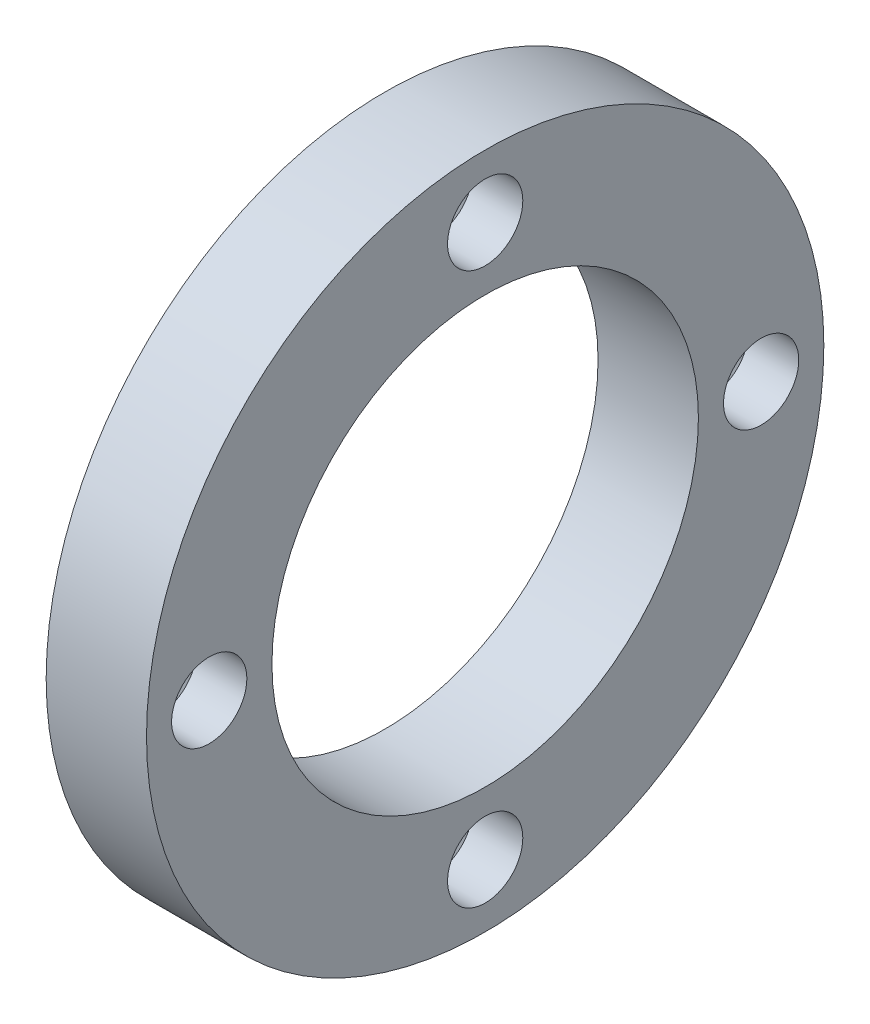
from build123d import *

# Parameters (mm, degrees)
SKIZZE1_W          = 4
SKIZZE1_H          = 5
KREISMUSTER1_COUNT = 4


with BuildPart() as part:
    # Skizze1 → Rotation1 (revolve)
    with BuildSketch(Plane.XY, mode=Mode.PRIVATE) as rotation1_sk:
        with Locations((2, 11)):
            Rectangle(SKIZZE1_W, SKIZZE1_H)
    revolve(rotation1_sk.sketch.rotate(Axis((0, 0, 0), (1, 0, 0)), 90), axis=Axis((0, 0, 0), (1, 0, 0)))

    # Skizze4 → 3.0 _3_ Durchmesser Bohrung1 (revolve, cut)
    with BuildSketch(Plane(origin=(4, 11, 0), x_dir=(0, 0, -1), z_dir=(0, 1, 0))):
        Polygon((0, 0), (0, 2.901290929), (1.5, 2), (1.5, 0), align=None)
    f_3_0_3_durchmesser_bohrung1 = revolve(axis=Axis((10.35, 11, 0), (-1, 0, 0)), mode=Mode.SUBTRACT)

    # Kreismuster1: 3.0 _3_ Durchmesser Bohrung1 ×4 about axis
    kreismuster1_axis = Axis((0, 0, 0), (1, 0, 0))
    for i in range(1, KREISMUSTER1_COUNT):
        add(f_3_0_3_durchmesser_bohrung1.rotate(kreismuster1_axis, i * 360 / KREISMUSTER1_COUNT), mode=Mode.SUBTRACT)


solid = part.part
